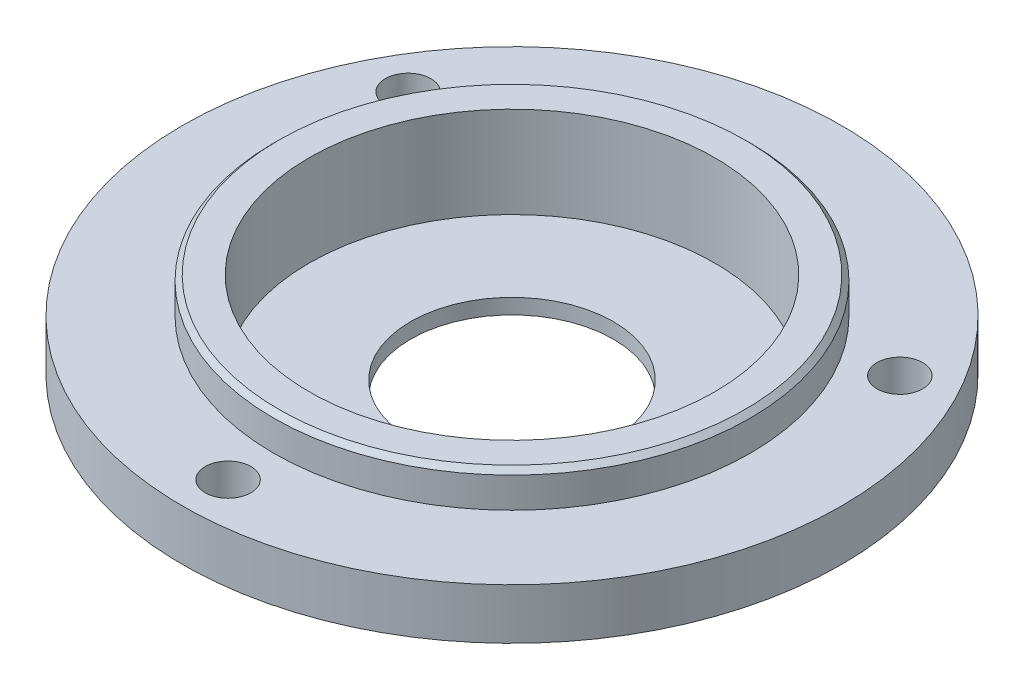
ISO-10303-21;
HEADER;
FILE_DESCRIPTION(('STEP AP214'),'2;1');
FILE_NAME('part.step','',(''),(''),'','','');
FILE_SCHEMA(('AUTOMOTIVE_DESIGN { 1 0 10303 214 1 1 1 1 }'));
ENDSEC;
DATA;
#1=APPLICATION_CONTEXT('core data for automotive mechanical design processes');
#2=APPLICATION_PROTOCOL_DEFINITION('international standard','automotive_design',2000,#1);
#3=PRODUCT_CONTEXT('',#1,'mechanical');
#4=PRODUCT('Part','Part','',(#3));
#5=PRODUCT_RELATED_PRODUCT_CATEGORY('part','',(#4));
#6=PRODUCT_DEFINITION_FORMATION('','',#4);
#7=PRODUCT_DEFINITION_CONTEXT('part definition',#1,'design');
#8=PRODUCT_DEFINITION('design','',#6,#7);
#9=PRODUCT_DEFINITION_SHAPE('','',#8);
#10=(LENGTH_UNIT() NAMED_UNIT(*) SI_UNIT(.MILLI.,.METRE.));
#11=(NAMED_UNIT(*) PLANE_ANGLE_UNIT() SI_UNIT($,.RADIAN.));
#12=(NAMED_UNIT(*) SI_UNIT($,.STERADIAN.) SOLID_ANGLE_UNIT());
#13=UNCERTAINTY_MEASURE_WITH_UNIT(LENGTH_MEASURE(1.E-05),#10,'distance_accuracy_value','');
#14=(GEOMETRIC_REPRESENTATION_CONTEXT(3) GLOBAL_UNCERTAINTY_ASSIGNED_CONTEXT((#13)) GLOBAL_UNIT_ASSIGNED_CONTEXT((#10,
#11,#12)) REPRESENTATION_CONTEXT('',''));
#15=CARTESIAN_POINT('',(0.,0.,0.));
#16=DIRECTION('',(0.,0.,1.));
#17=DIRECTION('',(1.,0.,0.));
#18=AXIS2_PLACEMENT_3D('',#15,#16,#17);
#19=CARTESIAN_POINT('',(-22.,-7.00000000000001,0.));
#20=DIRECTION('',(0.,-1.,0.));
#21=DIRECTION('',(1.,0.,0.));
#22=AXIS2_PLACEMENT_3D('',#19,#20,#21);
#23=PLANE('',#22);
#24=CARTESIAN_POINT('',(0.,-7.00000000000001,0.));
#25=DIRECTION('',(0.,1.,0.));
#26=DIRECTION('',(-1.,0.,0.));
#27=AXIS2_PLACEMENT_3D('',#24,#25,#26);
#28=CIRCLE('',#27,10.);
#29=CARTESIAN_POINT('',(-10.,-7.00000000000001,0.));
#30=VERTEX_POINT('',#29);
#31=EDGE_CURVE('E10',#30,#30,#28,.T.);
#32=ORIENTED_EDGE('',*,*,#31,.T.);
#33=EDGE_LOOP('',(#32));
#34=FACE_BOUND('',#33,.T.);
#35=CARTESIAN_POINT('',(0.,-7.00000000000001,0.));
#36=DIRECTION('',(0.,1.,0.));
#37=DIRECTION('',(-1.,0.,0.));
#38=AXIS2_PLACEMENT_3D('',#35,#36,#37);
#39=CIRCLE('',#38,22.);
#40=CARTESIAN_POINT('',(-22.,-7.00000000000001,0.));
#41=VERTEX_POINT('',#40);
#42=EDGE_CURVE('E49',#41,#41,#39,.T.);
#43=ORIENTED_EDGE('',*,*,#42,.F.);
#44=EDGE_LOOP('',(#43));
#45=FACE_BOUND('',#44,.T.);
#46=ADVANCED_FACE('F31',(#34,#45),#23,.T.);
#47=CARTESIAN_POINT('',(0.,39.1070951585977,0.));
#48=DIRECTION('',(0.,1.,0.));
#49=DIRECTION('',(-1.,0.,0.));
#50=AXIS2_PLACEMENT_3D('',#47,#48,#49);
#51=CYLINDRICAL_SURFACE('',#50,10.);
#52=CARTESIAN_POINT('',(0.,-5.50000000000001,0.));
#53=DIRECTION('',(0.,1.,0.));
#54=DIRECTION('',(-1.,0.,0.));
#55=AXIS2_PLACEMENT_3D('',#52,#53,#54);
#56=CIRCLE('',#55,10.);
#57=CARTESIAN_POINT('',(-10.,-5.50000000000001,0.));
#58=VERTEX_POINT('',#57);
#59=EDGE_CURVE('E38',#58,#58,#56,.T.);
#60=ORIENTED_EDGE('',*,*,#59,.T.);
#61=EDGE_LOOP('',(#60));
#62=FACE_BOUND('',#61,.T.);
#63=ORIENTED_EDGE('',*,*,#31,.F.);
#64=EDGE_LOOP('',(#63));
#65=FACE_BOUND('',#64,.T.);
#66=ADVANCED_FACE('F106',(#62,#65),#51,.F.);
#67=CARTESIAN_POINT('',(-9.99999999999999,-5.50000000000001,0.));
#68=DIRECTION('',(0.,1.,0.));
#69=DIRECTION('',(-1.,0.,0.));
#70=AXIS2_PLACEMENT_3D('',#67,#68,#69);
#71=PLANE('',#70);
#72=CARTESIAN_POINT('',(0.,-5.50000000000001,0.));
#73=DIRECTION('',(0.,1.,0.));
#74=DIRECTION('',(-1.,0.,0.));
#75=AXIS2_PLACEMENT_3D('',#72,#73,#74);
#76=CIRCLE('',#75,20.);
#77=CARTESIAN_POINT('',(-20.,-5.50000000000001,0.));
#78=VERTEX_POINT('',#77);
#79=EDGE_CURVE('E43',#78,#78,#76,.T.);
#80=ORIENTED_EDGE('',*,*,#79,.T.);
#81=EDGE_LOOP('',(#80));
#82=FACE_BOUND('',#81,.T.);
#83=ORIENTED_EDGE('',*,*,#59,.F.);
#84=EDGE_LOOP('',(#83));
#85=FACE_BOUND('',#84,.T.);
#86=ADVANCED_FACE('F91',(#82,#85),#71,.T.);
#87=CARTESIAN_POINT('',(0.,39.1070951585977,0.));
#88=DIRECTION('',(0.,1.,0.));
#89=DIRECTION('',(-1.,0.,0.));
#90=AXIS2_PLACEMENT_3D('',#87,#88,#89);
#91=CYLINDRICAL_SURFACE('',#90,20.);
#92=CARTESIAN_POINT('',(0.,3.5,0.));
#93=DIRECTION('',(0.,1.,0.));
#94=DIRECTION('',(-1.,0.,0.));
#95=AXIS2_PLACEMENT_3D('',#92,#93,#94);
#96=CIRCLE('',#95,20.);
#97=CARTESIAN_POINT('',(-20.,3.5,0.));
#98=VERTEX_POINT('',#97);
#99=EDGE_CURVE('E86',#98,#98,#96,.T.);
#100=ORIENTED_EDGE('',*,*,#99,.T.);
#101=EDGE_LOOP('',(#100));
#102=FACE_BOUND('',#101,.T.);
#103=ORIENTED_EDGE('',*,*,#79,.F.);
#104=EDGE_LOOP('',(#103));
#105=FACE_BOUND('',#104,.T.);
#106=ADVANCED_FACE('F94',(#102,#105),#91,.F.);
#107=CARTESIAN_POINT('',(-20.,3.5,0.));
#108=DIRECTION('',(0.,1.,0.));
#109=DIRECTION('',(-1.,0.,0.));
#110=AXIS2_PLACEMENT_3D('',#107,#108,#109);
#111=PLANE('',#110);
#112=CARTESIAN_POINT('',(0.,3.5,0.));
#113=DIRECTION('',(0.,1.,0.));
#114=DIRECTION('',(-1.,0.,0.));
#115=AXIS2_PLACEMENT_3D('',#112,#113,#114);
#116=CIRCLE('',#115,23.);
#117=CARTESIAN_POINT('',(-23.,3.5,0.));
#118=VERTEX_POINT('',#117);
#119=EDGE_CURVE('E83',#118,#118,#116,.T.);
#120=ORIENTED_EDGE('',*,*,#119,.T.);
#121=EDGE_LOOP('',(#120));
#122=FACE_BOUND('',#121,.T.);
#123=ORIENTED_EDGE('',*,*,#99,.F.);
#124=EDGE_LOOP('',(#123));
#125=FACE_BOUND('',#124,.T.);
#126=ADVANCED_FACE('F96',(#122,#125),#111,.T.);
#127=CARTESIAN_POINT('',(0.,3.5,0.));
#128=DIRECTION('',(0.,-1.,0.));
#129=DIRECTION('',(1.,0.,0.));
#130=AXIS2_PLACEMENT_3D('',#127,#128,#129);
#131=CONICAL_SURFACE('',#130,23.,0.785398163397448);
#132=CARTESIAN_POINT('',(0.,3.,0.));
#133=DIRECTION('',(0.,1.,0.));
#134=DIRECTION('',(-1.,0.,0.));
#135=AXIS2_PLACEMENT_3D('',#132,#133,#134);
#136=CIRCLE('',#135,23.5);
#137=CARTESIAN_POINT('',(-23.5,3.,0.));
#138=VERTEX_POINT('',#137);
#139=EDGE_CURVE('E80',#138,#138,#136,.T.);
#140=ORIENTED_EDGE('',*,*,#139,.T.);
#141=EDGE_LOOP('',(#140));
#142=FACE_BOUND('',#141,.T.);
#143=ORIENTED_EDGE('',*,*,#119,.F.);
#144=EDGE_LOOP('',(#143));
#145=FACE_BOUND('',#144,.T.);
#146=ADVANCED_FACE('F103',(#142,#145),#131,.T.);
#147=CARTESIAN_POINT('',(0.,39.1070951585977,0.));
#148=DIRECTION('',(0.,1.,0.));
#149=DIRECTION('',(-1.,0.,0.));
#150=AXIS2_PLACEMENT_3D('',#147,#148,#149);
#151=CYLINDRICAL_SURFACE('',#150,23.5);
#152=CARTESIAN_POINT('',(0.,0.,0.));
#153=DIRECTION('',(0.,1.,0.));
#154=DIRECTION('',(-1.,0.,0.));
#155=AXIS2_PLACEMENT_3D('',#152,#153,#154);
#156=CIRCLE('',#155,23.5);
#157=CARTESIAN_POINT('',(-23.5,0.,0.));
#158=VERTEX_POINT('',#157);
#159=EDGE_CURVE('E77',#158,#158,#156,.T.);
#160=ORIENTED_EDGE('',*,*,#159,.T.);
#161=EDGE_LOOP('',(#160));
#162=FACE_BOUND('',#161,.T.);
#163=ORIENTED_EDGE('',*,*,#139,.F.);
#164=EDGE_LOOP('',(#163));
#165=FACE_BOUND('',#164,.T.);
#166=ADVANCED_FACE('F139',(#162,#165),#151,.T.);
#167=CARTESIAN_POINT('',(-23.5,0.,0.));
#168=DIRECTION('',(0.,1.,0.));
#169=DIRECTION('',(-1.,0.,0.));
#170=AXIS2_PLACEMENT_3D('',#167,#168,#169);
#171=PLANE('',#170);
#172=CARTESIAN_POINT('',(24.2487113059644,0.,-13.9999999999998));
#173=DIRECTION('',(0.,1.,0.));
#174=DIRECTION('',(0.499999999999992,0.,0.866025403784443));
#175=AXIS2_PLACEMENT_3D('',#172,#173,#174);
#176=CIRCLE('',#175,2.25);
#177=CARTESIAN_POINT('',(25.3737113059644,0.,-12.0514428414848));
#178=VERTEX_POINT('',#177);
#179=EDGE_CURVE('E63',#178,#178,#176,.T.);
#180=ORIENTED_EDGE('',*,*,#179,.F.);
#181=EDGE_LOOP('',(#180));
#182=FACE_BOUND('',#181,.T.);
#183=CARTESIAN_POINT('',(-24.2487113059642,0.,-14.0000000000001));
#184=DIRECTION('',(0.,1.,0.));
#185=DIRECTION('',(0.500000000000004,0.,-0.866025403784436));
#186=AXIS2_PLACEMENT_3D('',#183,#184,#185);
#187=CIRCLE('',#186,2.25);
#188=CARTESIAN_POINT('',(-23.1237113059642,0.,-15.9485571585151));
#189=VERTEX_POINT('',#188);
#190=EDGE_CURVE('E53',#189,#189,#187,.T.);
#191=ORIENTED_EDGE('',*,*,#190,.F.);
#192=EDGE_LOOP('',(#191));
#193=FACE_BOUND('',#192,.T.);
#194=CARTESIAN_POINT('',(0.,0.,28.));
#195=DIRECTION('',(0.,1.,0.));
#196=DIRECTION('',(-1.,0.,0.));
#197=AXIS2_PLACEMENT_3D('',#194,#195,#196);
#198=CIRCLE('',#197,2.25);
#199=CARTESIAN_POINT('',(-2.25,0.,28.));
#200=VERTEX_POINT('',#199);
#201=EDGE_CURVE('E50',#200,#200,#198,.T.);
#202=ORIENTED_EDGE('',*,*,#201,.F.);
#203=EDGE_LOOP('',(#202));
#204=FACE_BOUND('',#203,.T.);
#205=CARTESIAN_POINT('',(0.,0.,0.));
#206=DIRECTION('',(0.,1.,0.));
#207=DIRECTION('',(-1.,0.,0.));
#208=AXIS2_PLACEMENT_3D('',#205,#206,#207);
#209=CIRCLE('',#208,32.5);
#210=CARTESIAN_POINT('',(-32.5,0.,0.));
#211=VERTEX_POINT('',#210);
#212=EDGE_CURVE('E74',#211,#211,#209,.T.);
#213=ORIENTED_EDGE('',*,*,#212,.T.);
#214=EDGE_LOOP('',(#213));
#215=FACE_BOUND('',#214,.T.);
#216=ORIENTED_EDGE('',*,*,#159,.F.);
#217=EDGE_LOOP('',(#216));
#218=FACE_BOUND('',#217,.T.);
#219=ADVANCED_FACE('F133',(#182,#193,#204,#215,#218),#171,.T.);
#220=CARTESIAN_POINT('',(0.,39.1070951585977,0.));
#221=DIRECTION('',(0.,1.,0.));
#222=DIRECTION('',(-1.,0.,0.));
#223=AXIS2_PLACEMENT_3D('',#220,#221,#222);
#224=CYLINDRICAL_SURFACE('',#223,32.5);
#225=CARTESIAN_POINT('',(0.,-5.,0.));
#226=DIRECTION('',(0.,1.,0.));
#227=DIRECTION('',(-1.,0.,0.));
#228=AXIS2_PLACEMENT_3D('',#225,#226,#227);
#229=CIRCLE('',#228,32.5);
#230=CARTESIAN_POINT('',(-32.5,-5.00000000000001,0.));
#231=VERTEX_POINT('',#230);
#232=EDGE_CURVE('E71',#231,#231,#229,.T.);
#233=ORIENTED_EDGE('',*,*,#232,.T.);
#234=EDGE_LOOP('',(#233));
#235=FACE_BOUND('',#234,.T.);
#236=ORIENTED_EDGE('',*,*,#212,.F.);
#237=EDGE_LOOP('',(#236));
#238=FACE_BOUND('',#237,.T.);
#239=ADVANCED_FACE('F126',(#235,#238),#224,.T.);
#240=CARTESIAN_POINT('',(-32.5,-5.,0.));
#241=DIRECTION('',(0.,-1.,0.));
#242=DIRECTION('',(1.,0.,0.));
#243=AXIS2_PLACEMENT_3D('',#240,#241,#242);
#244=PLANE('',#243);
#245=CARTESIAN_POINT('',(24.2487113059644,-5.,-13.9999999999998));
#246=DIRECTION('',(0.,-1.,0.));
#247=DIRECTION('',(1.,0.,0.));
#248=AXIS2_PLACEMENT_3D('',#245,#246,#247);
#249=CIRCLE('',#248,2.25);
#250=CARTESIAN_POINT('',(26.4987113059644,-5.,-13.9999999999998));
#251=VERTEX_POINT('',#250);
#252=EDGE_CURVE('E34',#251,#251,#249,.T.);
#253=ORIENTED_EDGE('',*,*,#252,.F.);
#254=EDGE_LOOP('',(#253));
#255=FACE_BOUND('',#254,.T.);
#256=CARTESIAN_POINT('',(-24.2487113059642,-5.,-14.0000000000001));
#257=DIRECTION('',(0.,-1.,0.));
#258=DIRECTION('',(1.,0.,0.));
#259=AXIS2_PLACEMENT_3D('',#256,#257,#258);
#260=CIRCLE('',#259,2.25);
#261=CARTESIAN_POINT('',(-21.9987113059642,-5.,-14.0000000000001));
#262=VERTEX_POINT('',#261);
#263=EDGE_CURVE('E51',#262,#262,#260,.T.);
#264=ORIENTED_EDGE('',*,*,#263,.F.);
#265=EDGE_LOOP('',(#264));
#266=FACE_BOUND('',#265,.T.);
#267=CARTESIAN_POINT('',(0.,-5.,28.));
#268=DIRECTION('',(0.,-1.,0.));
#269=DIRECTION('',(1.,0.,0.));
#270=AXIS2_PLACEMENT_3D('',#267,#268,#269);
#271=CIRCLE('',#270,2.25);
#272=CARTESIAN_POINT('',(2.25,-5.,28.));
#273=VERTEX_POINT('',#272);
#274=EDGE_CURVE('E47',#273,#273,#271,.T.);
#275=ORIENTED_EDGE('',*,*,#274,.F.);
#276=EDGE_LOOP('',(#275));
#277=FACE_BOUND('',#276,.T.);
#278=CARTESIAN_POINT('',(0.,-5.,0.));
#279=DIRECTION('',(0.,1.,0.));
#280=DIRECTION('',(-1.,0.,0.));
#281=AXIS2_PLACEMENT_3D('',#278,#279,#280);
#282=CIRCLE('',#281,22.);
#283=CARTESIAN_POINT('',(-22.,-5.00000000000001,0.));
#284=VERTEX_POINT('',#283);
#285=EDGE_CURVE('E68',#284,#284,#282,.T.);
#286=ORIENTED_EDGE('',*,*,#285,.T.);
#287=EDGE_LOOP('',(#286));
#288=FACE_BOUND('',#287,.T.);
#289=ORIENTED_EDGE('',*,*,#232,.F.);
#290=EDGE_LOOP('',(#289));
#291=FACE_BOUND('',#290,.T.);
#292=ADVANCED_FACE('F120',(#255,#266,#277,#288,#291),#244,.T.);
#293=CARTESIAN_POINT('',(0.,39.1070951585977,0.));
#294=DIRECTION('',(0.,1.,0.));
#295=DIRECTION('',(-1.,0.,0.));
#296=AXIS2_PLACEMENT_3D('',#293,#294,#295);
#297=CYLINDRICAL_SURFACE('',#296,22.);
#298=ORIENTED_EDGE('',*,*,#42,.T.);
#299=EDGE_LOOP('',(#298));
#300=FACE_BOUND('',#299,.T.);
#301=ORIENTED_EDGE('',*,*,#285,.F.);
#302=EDGE_LOOP('',(#301));
#303=FACE_BOUND('',#302,.T.);
#304=ADVANCED_FACE('F116',(#300,#303),#297,.T.);
#305=CARTESIAN_POINT('',(0.,-7.00000000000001,28.));
#306=DIRECTION('',(0.,1.,0.));
#307=DIRECTION('',(-1.,0.,0.));
#308=AXIS2_PLACEMENT_3D('',#305,#306,#307);
#309=CYLINDRICAL_SURFACE('',#308,2.25);
#310=ORIENTED_EDGE('',*,*,#274,.T.);
#311=EDGE_LOOP('',(#310));
#312=FACE_BOUND('',#311,.T.);
#313=ORIENTED_EDGE('',*,*,#201,.T.);
#314=EDGE_LOOP('',(#313));
#315=FACE_BOUND('',#314,.T.);
#316=ADVANCED_FACE('F119',(#312,#315),#309,.F.);
#317=CARTESIAN_POINT('',(-24.2487113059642,-7.00000000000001,-14.0000000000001));
#318=DIRECTION('',(0.,1.,0.));
#319=DIRECTION('',(-1.,0.,0.));
#320=AXIS2_PLACEMENT_3D('',#317,#318,#319);
#321=CYLINDRICAL_SURFACE('',#320,2.25);
#322=ORIENTED_EDGE('',*,*,#263,.T.);
#323=EDGE_LOOP('',(#322));
#324=FACE_BOUND('',#323,.T.);
#325=ORIENTED_EDGE('',*,*,#190,.T.);
#326=EDGE_LOOP('',(#325));
#327=FACE_BOUND('',#326,.T.);
#328=ADVANCED_FACE('F160',(#324,#327),#321,.F.);
#329=CARTESIAN_POINT('',(24.2487113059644,-7.00000000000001,-13.9999999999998));
#330=DIRECTION('',(0.,1.,0.));
#331=DIRECTION('',(-1.,0.,0.));
#332=AXIS2_PLACEMENT_3D('',#329,#330,#331);
#333=CYLINDRICAL_SURFACE('',#332,2.25);
#334=ORIENTED_EDGE('',*,*,#252,.T.);
#335=EDGE_LOOP('',(#334));
#336=FACE_BOUND('',#335,.T.);
#337=ORIENTED_EDGE('',*,*,#179,.T.);
#338=EDGE_LOOP('',(#337));
#339=FACE_BOUND('',#338,.T.);
#340=ADVANCED_FACE('F164',(#336,#339),#333,.F.);
#341=CLOSED_SHELL('',(#46,#66,#86,#106,#126,#146,#166,#219,#239,#292,#304,#316,#328,#340));
#342=MANIFOLD_SOLID_BREP('B2',#341);
#343=ADVANCED_BREP_SHAPE_REPRESENTATION('',(#18,#342),#14);
#344=SHAPE_DEFINITION_REPRESENTATION(#9,#343);
ENDSEC;
END-ISO-10303-21;
